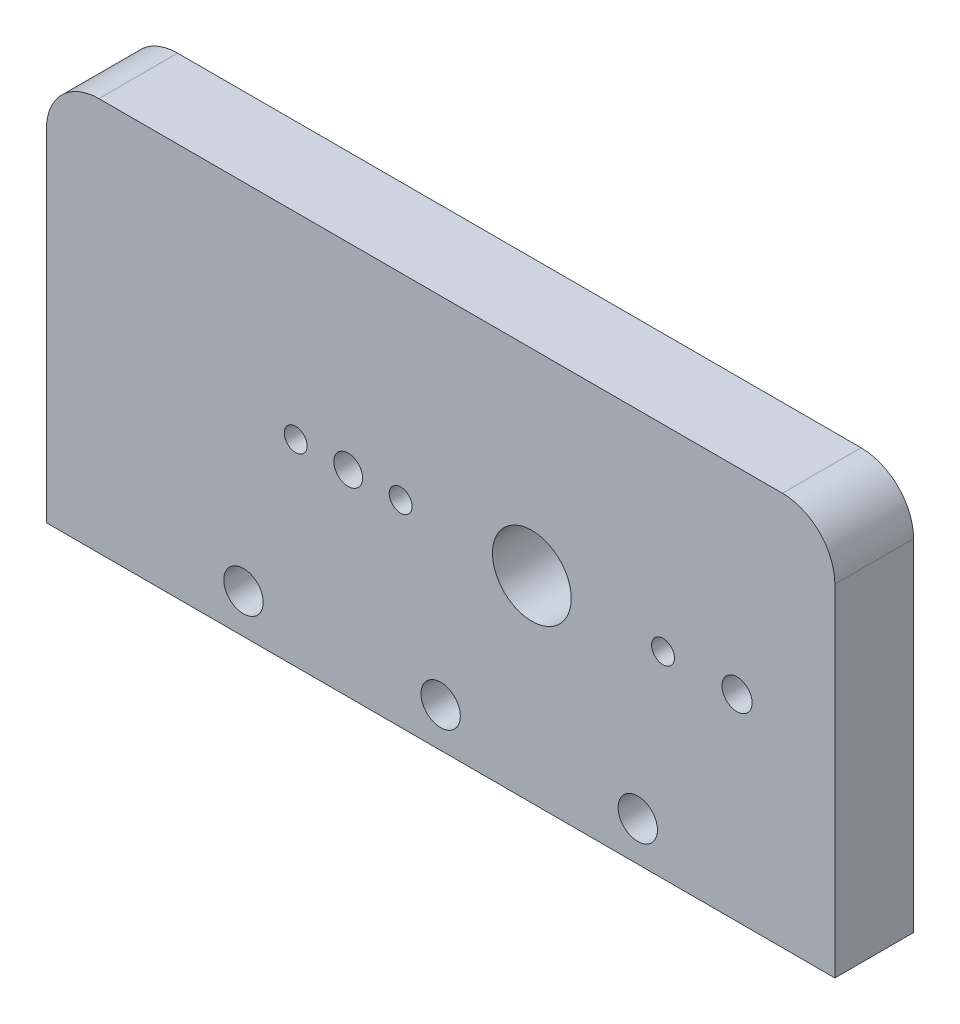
from build123d import *

# Parameters (mm, degrees)
SKETCH1_R           = 3
SKETCH1_R_2         = 0.87
SKETCH1_R_3         = 1.1
SKETCH1_R_4         = 1.15
SKETCH1_R_5         = 1.5
BOSS_EXTRUDE4_DEPTH = 6


with BuildPart() as part:
    # Sketch1 → Boss-Extrude4 (new body)
    with BuildSketch(Plane.XY):
        with BuildLine():
            Line((38.03975457, -3.971638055), (38.03975457, 22.028361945))
            ThreePointArc((38.03975457, 22.028361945), (36.868181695, 24.856789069), (34.03975457, 26.028361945))
            Line((34.03975457, 26.028361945), (-18.057843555, 26.028361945))
            ThreePointArc((-18.057843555, 26.028361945), (-20.886270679, 24.856789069), (-22.057843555, 22.028361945))
            Line((-22.057843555, 22.028361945), (-22.057843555, -3.971638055))
            Line((-22.057843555, -3.971638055), (38.03975457, -3.971638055))
        make_face()
        with Locations((14.942156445, 11.028361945)):
            Circle(SKETCH1_R, mode=Mode.SUBTRACT)
        with Locations((4.942156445, 11.028361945)):
            Circle(SKETCH1_R_2, mode=Mode.SUBTRACT)
        with Locations((0.942156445, 11.028361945)):
            Circle(SKETCH1_R_3, mode=Mode.SUBTRACT)
        with Locations((-3.057843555, 11.028361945)):
            Circle(SKETCH1_R_2, mode=Mode.SUBTRACT)
        with Locations((24.942156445, 11.028361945)):
            Circle(SKETCH1_R_2, mode=Mode.SUBTRACT)
        with Locations((30.582156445, 11.028361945)):
            Circle(SKETCH1_R_4, mode=Mode.SUBTRACT)
        with Locations((23.015355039, -0.971638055)):
            Circle(SKETCH1_R_5, mode=Mode.SUBTRACT)
        with Locations((7.990955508, -0.971638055)):
            Circle(SKETCH1_R_5, mode=Mode.SUBTRACT)
        with Locations(Location((-7.033444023, -0.971638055, 0), (0, 0, 180))):
            Circle(SKETCH1_R_5, mode=Mode.SUBTRACT)
    extrude(amount=BOSS_EXTRUDE4_DEPTH)


solid = part.part
